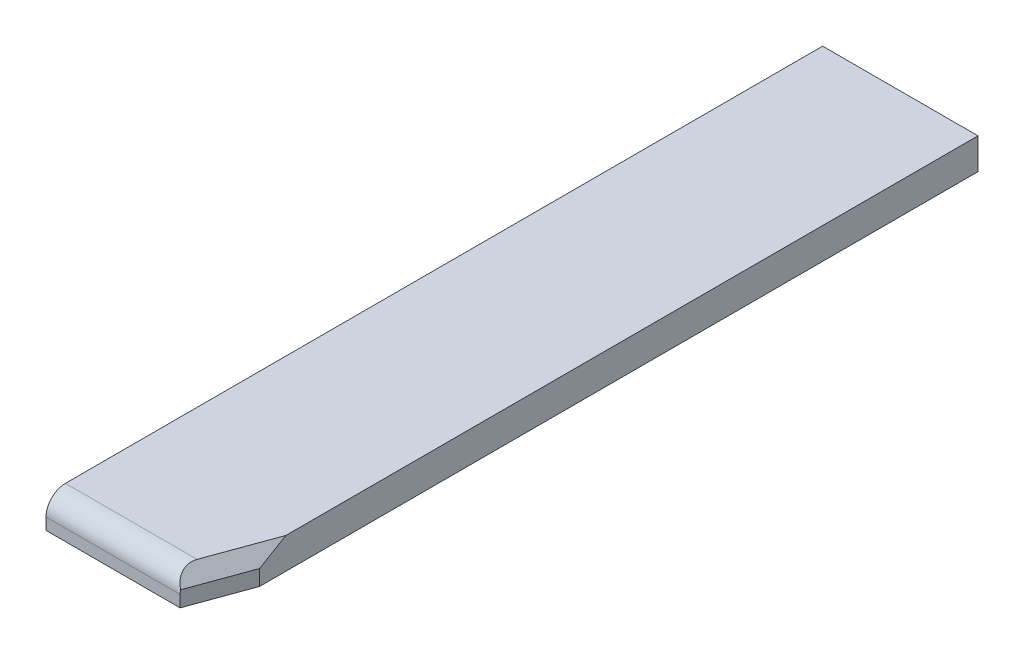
ISO-10303-21;
HEADER;
FILE_DESCRIPTION(('STEP AP214'),'2;1');
FILE_NAME('part.step','',(''),(''),'','','');
FILE_SCHEMA(('AUTOMOTIVE_DESIGN { 1 0 10303 214 1 1 1 1 }'));
ENDSEC;
DATA;
#1=APPLICATION_CONTEXT('core data for automotive mechanical design processes');
#2=APPLICATION_PROTOCOL_DEFINITION('international standard','automotive_design',2000,#1);
#3=PRODUCT_CONTEXT('',#1,'mechanical');
#4=PRODUCT('Part','Part','',(#3));
#5=PRODUCT_RELATED_PRODUCT_CATEGORY('part','',(#4));
#6=PRODUCT_DEFINITION_FORMATION('','',#4);
#7=PRODUCT_DEFINITION_CONTEXT('part definition',#1,'design');
#8=PRODUCT_DEFINITION('design','',#6,#7);
#9=PRODUCT_DEFINITION_SHAPE('','',#8);
#10=(LENGTH_UNIT() NAMED_UNIT(*) SI_UNIT(.MILLI.,.METRE.));
#11=(NAMED_UNIT(*) PLANE_ANGLE_UNIT() SI_UNIT($,.RADIAN.));
#12=(NAMED_UNIT(*) SI_UNIT($,.STERADIAN.) SOLID_ANGLE_UNIT());
#13=UNCERTAINTY_MEASURE_WITH_UNIT(LENGTH_MEASURE(1.E-05),#10,'distance_accuracy_value','');
#14=(GEOMETRIC_REPRESENTATION_CONTEXT(3) GLOBAL_UNCERTAINTY_ASSIGNED_CONTEXT((#13)) GLOBAL_UNIT_ASSIGNED_CONTEXT((#10,
#11,#12)) REPRESENTATION_CONTEXT('',''));
#15=CARTESIAN_POINT('',(0.,0.,0.));
#16=DIRECTION('',(0.,0.,1.));
#17=DIRECTION('',(1.,0.,0.));
#18=AXIS2_PLACEMENT_3D('',#15,#16,#17);
#19=CARTESIAN_POINT('',(-20.,8.00000000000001,-200.));
#20=DIRECTION('',(0.,1.,0.));
#21=DIRECTION('',(0.,0.,1.));
#22=AXIS2_PLACEMENT_3D('',#19,#20,#21);
#23=PLANE('',#22);
#24=DIRECTION('',(0.,0.,1.));
#25=VECTOR('',#24,1.);
#26=CARTESIAN_POINT('',(-20.,8.00000000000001,-200.));
#27=LINE('',#26,#25);
#28=CARTESIAN_POINT('',(-20.,8.00000000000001,-200.));
#29=VERTEX_POINT('',#28);
#30=CARTESIAN_POINT('',(-20.,8.00000000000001,-5.));
#31=VERTEX_POINT('',#30);
#32=EDGE_CURVE('E121',#29,#31,#27,.T.);
#33=ORIENTED_EDGE('',*,*,#32,.T.);
#34=DIRECTION('',(-1.,0.,0.));
#35=VECTOR('',#34,1.);
#36=CARTESIAN_POINT('',(20.001,8.00000000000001,-5.));
#37=LINE('',#36,#35);
#38=CARTESIAN_POINT('',(13.9026843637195,8.00000000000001,-4.99999999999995));
#39=VERTEX_POINT('',#38);
#40=EDGE_CURVE('E104',#39,#31,#37,.T.);
#41=ORIENTED_EDGE('',*,*,#40,.F.);
#42=DIRECTION('',(0.342020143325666,0.,-0.939692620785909));
#43=VECTOR('',#42,1.);
#44=CARTESIAN_POINT('',(72.608615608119,8.00000000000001,-166.293220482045));
#45=LINE('',#44,#43);
#46=CARTESIAN_POINT('',(20.,8.00000000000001,-21.7522370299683));
#47=VERTEX_POINT('',#46);
#48=EDGE_CURVE('E137',#39,#47,#45,.T.);
#49=ORIENTED_EDGE('',*,*,#48,.T.);
#50=DIRECTION('',(0.,0.,1.));
#51=VECTOR('',#50,1.);
#52=CARTESIAN_POINT('',(20.,8.00000000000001,-200.));
#53=LINE('',#52,#51);
#54=CARTESIAN_POINT('',(20.,8.00000000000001,-200.));
#55=VERTEX_POINT('',#54);
#56=EDGE_CURVE('E129',#55,#47,#53,.T.);
#57=ORIENTED_EDGE('',*,*,#56,.F.);
#58=DIRECTION('',(-1.,0.,0.));
#59=VECTOR('',#58,1.);
#60=CARTESIAN_POINT('',(-20.,8.00000000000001,-200.));
#61=LINE('',#60,#59);
#62=EDGE_CURVE('E142',#55,#29,#61,.T.);
#63=ORIENTED_EDGE('',*,*,#62,.T.);
#64=EDGE_LOOP('',(#33,#41,#49,#57,#63));
#65=FACE_BOUND('',#64,.T.);
#66=ADVANCED_FACE('F38',(#65),#23,.T.);
#67=CARTESIAN_POINT('',(-20.,8.00000000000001,0.));
#68=DIRECTION('',(0.,0.,-1.));
#69=DIRECTION('',(-1.,0.,0.));
#70=AXIS2_PLACEMENT_3D('',#67,#68,#69);
#71=PLANE('',#70);
#72=DIRECTION('',(-1.,0.,0.));
#73=VECTOR('',#72,1.);
#74=CARTESIAN_POINT('',(20.001,3.,0.));
#75=LINE('',#74,#73);
#76=CARTESIAN_POINT('',(14.540446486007,3.,0.));
#77=VERTEX_POINT('',#76);
#78=CARTESIAN_POINT('',(-20.,3.,0.));
#79=VERTEX_POINT('',#78);
#80=EDGE_CURVE('E96',#77,#79,#75,.T.);
#81=ORIENTED_EDGE('',*,*,#80,.T.);
#82=DIRECTION('',(0.,-1.,0.));
#83=VECTOR('',#82,1.);
#84=CARTESIAN_POINT('',(-20.,0.,0.));
#85=LINE('',#84,#83);
#86=CARTESIAN_POINT('',(-20.,0.,0.));
#87=VERTEX_POINT('',#86);
#88=EDGE_CURVE('E148',#79,#87,#85,.T.);
#89=ORIENTED_EDGE('',*,*,#88,.T.);
#90=DIRECTION('',(1.,0.,0.));
#91=VECTOR('',#90,1.);
#92=CARTESIAN_POINT('',(-20.,0.,0.));
#93=LINE('',#92,#91);
#94=CARTESIAN_POINT('',(14.5404464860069,0.,0.));
#95=VERTEX_POINT('',#94);
#96=EDGE_CURVE('E118',#87,#95,#93,.T.);
#97=ORIENTED_EDGE('',*,*,#96,.T.);
#98=DIRECTION('',(0.,1.,0.));
#99=VECTOR('',#98,1.);
#100=CARTESIAN_POINT('',(14.540446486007,8.00000000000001,0.));
#101=LINE('',#100,#99);
#102=EDGE_CURVE('E110',#95,#77,#101,.T.);
#103=ORIENTED_EDGE('',*,*,#102,.T.);
#104=EDGE_LOOP('',(#81,#89,#97,#103));
#105=FACE_BOUND('',#104,.T.);
#106=ADVANCED_FACE('F116',(#105),#71,.F.);
#107=CARTESIAN_POINT('',(-20.,0.,-200.));
#108=DIRECTION('',(-1.,0.,0.));
#109=DIRECTION('',(0.,0.,1.));
#110=AXIS2_PLACEMENT_3D('',#107,#108,#109);
#111=PLANE('',#110);
#112=CARTESIAN_POINT('',(-20.,3.,-5.));
#113=DIRECTION('',(1.,0.,0.));
#114=DIRECTION('',(0.,0.,1.));
#115=AXIS2_PLACEMENT_3D('',#112,#113,#114);
#116=CIRCLE('',#115,5.);
#117=EDGE_CURVE('E99',#31,#79,#116,.T.);
#118=ORIENTED_EDGE('',*,*,#117,.F.);
#119=ORIENTED_EDGE('',*,*,#32,.F.);
#120=DIRECTION('',(0.,-1.,0.));
#121=VECTOR('',#120,1.);
#122=CARTESIAN_POINT('',(-20.,0.,-200.));
#123=LINE('',#122,#121);
#124=CARTESIAN_POINT('',(-20.,0.,-200.));
#125=VERTEX_POINT('',#124);
#126=EDGE_CURVE('E155',#29,#125,#123,.T.);
#127=ORIENTED_EDGE('',*,*,#126,.T.);
#128=DIRECTION('',(0.,0.,1.));
#129=VECTOR('',#128,1.);
#130=CARTESIAN_POINT('',(-20.,0.,-200.));
#131=LINE('',#130,#129);
#132=EDGE_CURVE('E132',#125,#87,#131,.T.);
#133=ORIENTED_EDGE('',*,*,#132,.T.);
#134=ORIENTED_EDGE('',*,*,#88,.F.);
#135=EDGE_LOOP('',(#118,#119,#127,#133,#134));
#136=FACE_BOUND('',#135,.T.);
#137=ADVANCED_FACE('F40',(#136),#111,.T.);
#138=CARTESIAN_POINT('',(20.,0.,-200.));
#139=DIRECTION('',(1.,0.,0.));
#140=DIRECTION('',(0.,0.,-1.));
#141=AXIS2_PLACEMENT_3D('',#138,#139,#140);
#142=PLANE('',#141);
#143=ORIENTED_EDGE('',*,*,#56,.T.);
#144=DIRECTION('',(0.,0.509677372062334,-0.860365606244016));
#145=VECTOR('',#144,1.);
#146=CARTESIAN_POINT('',(20.,84.0850589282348,-150.188325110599));
#147=LINE('',#146,#145);
#148=CARTESIAN_POINT('',(20.,3.99999999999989,-15.0000000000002));
#149=VERTEX_POINT('',#148);
#150=EDGE_CURVE('E47',#47,#149,#147,.F.);
#151=ORIENTED_EDGE('',*,*,#150,.T.);
#152=DIRECTION('',(0.,-1.,0.));
#153=VECTOR('',#152,1.);
#154=CARTESIAN_POINT('',(20.,0.,-15.0000000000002));
#155=LINE('',#154,#153);
#156=CARTESIAN_POINT('',(20.,0.,-15.0000000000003));
#157=VERTEX_POINT('',#156);
#158=EDGE_CURVE('E120',#149,#157,#155,.T.);
#159=ORIENTED_EDGE('',*,*,#158,.T.);
#160=DIRECTION('',(0.,0.,1.));
#161=VECTOR('',#160,1.);
#162=CARTESIAN_POINT('',(20.,0.,-200.));
#163=LINE('',#162,#161);
#164=CARTESIAN_POINT('',(20.,0.,-200.));
#165=VERTEX_POINT('',#164);
#166=EDGE_CURVE('E160',#165,#157,#163,.T.);
#167=ORIENTED_EDGE('',*,*,#166,.F.);
#168=DIRECTION('',(0.,1.,0.));
#169=VECTOR('',#168,1.);
#170=CARTESIAN_POINT('',(20.,0.,-200.));
#171=LINE('',#170,#169);
#172=EDGE_CURVE('E140',#165,#55,#171,.T.);
#173=ORIENTED_EDGE('',*,*,#172,.T.);
#174=EDGE_LOOP('',(#143,#151,#159,#167,#173));
#175=FACE_BOUND('',#174,.T.);
#176=ADVANCED_FACE('F203',(#175),#142,.T.);
#177=CARTESIAN_POINT('',(-20.,0.,-200.));
#178=DIRECTION('',(0.,-1.,0.));
#179=DIRECTION('',(0.,0.,-1.));
#180=AXIS2_PLACEMENT_3D('',#177,#178,#179);
#181=PLANE('',#180);
#182=ORIENTED_EDGE('',*,*,#166,.T.);
#183=DIRECTION('',(-0.342020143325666,0.,0.939692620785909));
#184=VECTOR('',#183,1.);
#185=CARTESIAN_POINT('',(74.7787427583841,0.,-165.503358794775));
#186=LINE('',#185,#184);
#187=EDGE_CURVE('E125',#157,#95,#186,.T.);
#188=ORIENTED_EDGE('',*,*,#187,.T.);
#189=ORIENTED_EDGE('',*,*,#96,.F.);
#190=ORIENTED_EDGE('',*,*,#132,.F.);
#191=DIRECTION('',(1.,0.,0.));
#192=VECTOR('',#191,1.);
#193=CARTESIAN_POINT('',(-20.,0.,-200.));
#194=LINE('',#193,#192);
#195=EDGE_CURVE('E143',#125,#165,#194,.T.);
#196=ORIENTED_EDGE('',*,*,#195,.T.);
#197=EDGE_LOOP('',(#182,#188,#189,#190,#196));
#198=FACE_BOUND('',#197,.T.);
#199=ADVANCED_FACE('F183',(#198),#181,.T.);
#200=CARTESIAN_POINT('',(-20.,8.00000000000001,-200.));
#201=DIRECTION('',(0.,0.,-1.));
#202=DIRECTION('',(-1.,0.,0.));
#203=AXIS2_PLACEMENT_3D('',#200,#201,#202);
#204=PLANE('',#203);
#205=ORIENTED_EDGE('',*,*,#126,.F.);
#206=ORIENTED_EDGE('',*,*,#62,.F.);
#207=ORIENTED_EDGE('',*,*,#172,.F.);
#208=ORIENTED_EDGE('',*,*,#195,.F.);
#209=EDGE_LOOP('',(#205,#206,#207,#208));
#210=FACE_BOUND('',#209,.T.);
#211=ADVANCED_FACE('F179',(#210),#204,.T.);
#212=CARTESIAN_POINT('',(14.540446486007,8.00000000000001,0.));
#213=DIRECTION('',(0.939692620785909,0.,0.342020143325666));
#214=DIRECTION('',(0.342020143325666,0.,-0.939692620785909));
#215=AXIS2_PLACEMENT_3D('',#212,#213,#214);
#216=PLANE('',#215);
#217=CARTESIAN_POINT('',(16.360297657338,3.,-5.));
#218=DIRECTION('',(0.939692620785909,0.,0.342020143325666));
#219=DIRECTION('',(-0.342020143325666,0.,0.939692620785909));
#220=AXIS2_PLACEMENT_3D('',#217,#218,#219);
#221=ELLIPSE('',#220,5.32088886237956,5.);
#222=CARTESIAN_POINT('',(14.577214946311,3.99999999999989,-0.101020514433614));
#223=VERTEX_POINT('',#222);
#224=EDGE_CURVE('E54',#223,#77,#221,.T.);
#225=ORIENTED_EDGE('',*,*,#224,.T.);
#226=ORIENTED_EDGE('',*,*,#102,.F.);
#227=ORIENTED_EDGE('',*,*,#187,.F.);
#228=ORIENTED_EDGE('',*,*,#158,.F.);
#229=DIRECTION('',(-0.342020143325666,0.,0.939692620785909));
#230=VECTOR('',#229,1.);
#231=CARTESIAN_POINT('',(14.540446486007,3.99999999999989,0.));
#232=LINE('',#231,#230);
#233=EDGE_CURVE('E11',#149,#223,#232,.T.);
#234=ORIENTED_EDGE('',*,*,#233,.T.);
#235=EDGE_LOOP('',(#225,#226,#227,#228,#234));
#236=FACE_BOUND('',#235,.T.);
#237=ADVANCED_FACE('F108',(#236),#216,.T.);
#238=CARTESIAN_POINT('',(72.608615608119,8.00000000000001,-166.293220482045));
#239=DIRECTION('',(-0.813797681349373,-0.500000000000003,-0.296198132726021));
#240=DIRECTION('',(0.523490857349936,-0.85203129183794,0.));
#241=AXIS2_PLACEMENT_3D('',#238,#239,#240);
#242=PLANE('',#241);
#243=CARTESIAN_POINT('',(16.9747009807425,3.,-5.));
#244=DIRECTION('',(-0.813797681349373,-0.500000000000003,-0.296198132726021));
#245=DIRECTION('',(-0.581148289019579,0.700163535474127,0.414774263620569));
#246=AXIS2_PLACEMENT_3D('',#243,#244,#245);
#247=ELLIPSE('',#246,6.14403323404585,5.);
#248=EDGE_CURVE('E113',#39,#223,#247,.F.);
#249=ORIENTED_EDGE('',*,*,#248,.T.);
#250=ORIENTED_EDGE('',*,*,#233,.F.);
#251=ORIENTED_EDGE('',*,*,#150,.F.);
#252=ORIENTED_EDGE('',*,*,#48,.F.);
#253=EDGE_LOOP('',(#249,#250,#251,#252));
#254=FACE_BOUND('',#253,.T.);
#255=ADVANCED_FACE('F185',(#254),#242,.F.);
#256=CARTESIAN_POINT('',(20.001,3.,-5.));
#257=DIRECTION('',(-1.,0.,0.));
#258=DIRECTION('',(0.,0.,1.));
#259=AXIS2_PLACEMENT_3D('',#256,#257,#258);
#260=CYLINDRICAL_SURFACE('',#259,5.);
#261=ORIENTED_EDGE('',*,*,#248,.F.);
#262=ORIENTED_EDGE('',*,*,#40,.T.);
#263=ORIENTED_EDGE('',*,*,#117,.T.);
#264=ORIENTED_EDGE('',*,*,#80,.F.);
#265=ORIENTED_EDGE('',*,*,#224,.F.);
#266=EDGE_LOOP('',(#261,#262,#263,#264,#265));
#267=FACE_BOUND('',#266,.T.);
#268=ADVANCED_FACE('F97',(#267),#260,.T.);
#269=CLOSED_SHELL('',(#66,#106,#137,#176,#199,#211,#237,#255,#268));
#270=MANIFOLD_SOLID_BREP('B2',#269);
#271=ADVANCED_BREP_SHAPE_REPRESENTATION('',(#18,#270),#14);
#272=SHAPE_DEFINITION_REPRESENTATION(#9,#271);
ENDSEC;
END-ISO-10303-21;
